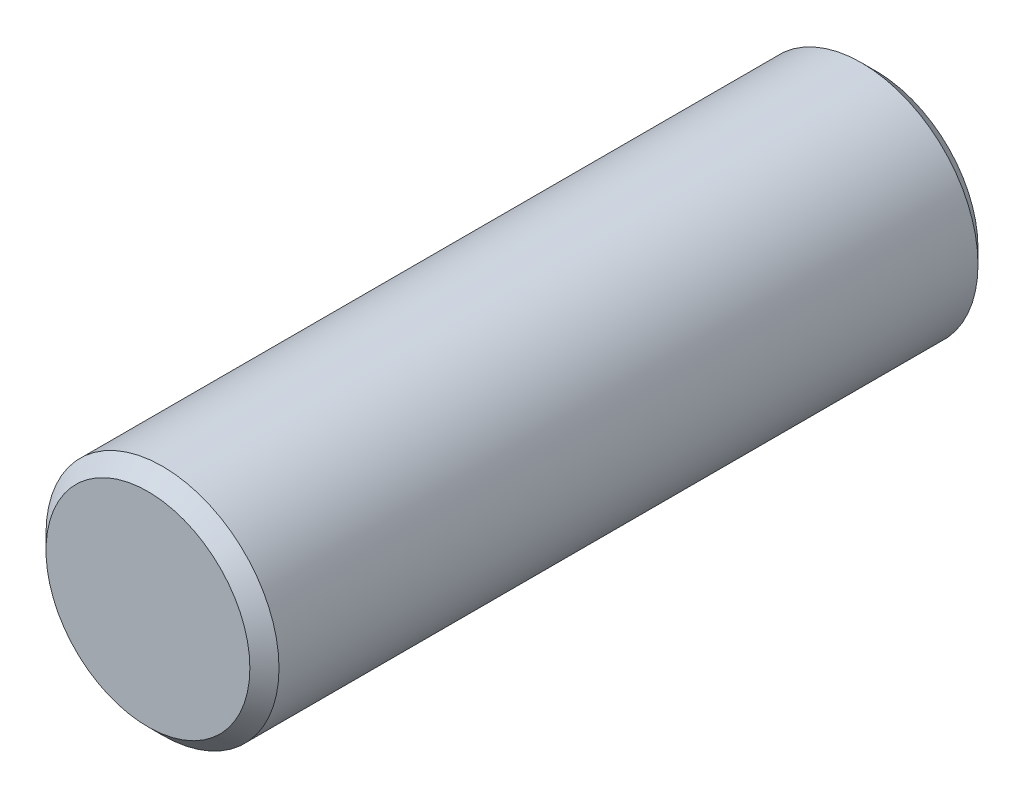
from build123d import *

# Parameters (mm, degrees)
ESQUISSE1_R        = 8
BOSS_EXTRU_1_DEPTH = 50
CHANFREIN1_SIZE    = 1


with BuildPart() as part:
    # Esquisse1 → Boss.-Extru.1 (new body)
    with BuildSketch(Plane.XY):
        Circle(ESQUISSE1_R)
    extrude(amount=BOSS_EXTRU_1_DEPTH)

    # Chanfrein1
    chanfrein1_edges = [part.edges().sort_by_distance(p)[0] for p in [
        (-8, 0, 0),
        (-8, 0, 50),
    ]]
    chamfer(chanfrein1_edges, length=CHANFREIN1_SIZE)


solid = part.part
